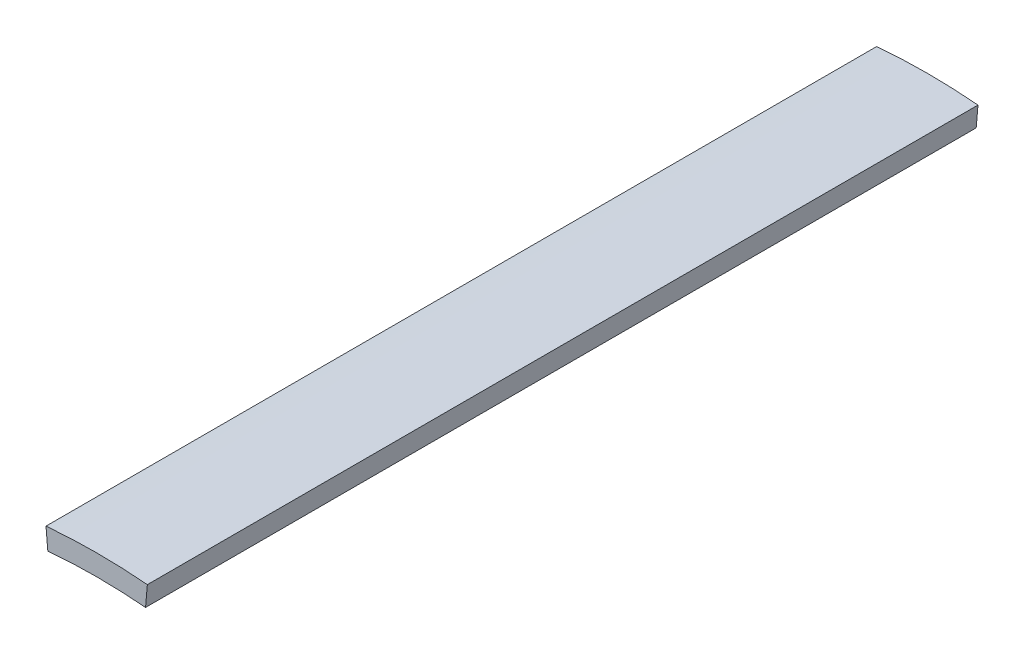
ISO-10303-21;
HEADER;
FILE_DESCRIPTION(('STEP AP214'),'2;1');
FILE_NAME('part.step','',(''),(''),'','','');
FILE_SCHEMA(('AUTOMOTIVE_DESIGN { 1 0 10303 214 1 1 1 1 }'));
ENDSEC;
DATA;
#1=APPLICATION_CONTEXT('core data for automotive mechanical design processes');
#2=APPLICATION_PROTOCOL_DEFINITION('international standard','automotive_design',2000,#1);
#3=PRODUCT_CONTEXT('',#1,'mechanical');
#4=PRODUCT('Part','Part','',(#3));
#5=PRODUCT_RELATED_PRODUCT_CATEGORY('part','',(#4));
#6=PRODUCT_DEFINITION_FORMATION('','',#4);
#7=PRODUCT_DEFINITION_CONTEXT('part definition',#1,'design');
#8=PRODUCT_DEFINITION('design','',#6,#7);
#9=PRODUCT_DEFINITION_SHAPE('','',#8);
#10=(LENGTH_UNIT() NAMED_UNIT(*) SI_UNIT(.MILLI.,.METRE.));
#11=(NAMED_UNIT(*) PLANE_ANGLE_UNIT() SI_UNIT($,.RADIAN.));
#12=(NAMED_UNIT(*) SI_UNIT($,.STERADIAN.) SOLID_ANGLE_UNIT());
#13=UNCERTAINTY_MEASURE_WITH_UNIT(LENGTH_MEASURE(1.E-05),#10,'distance_accuracy_value','');
#14=(GEOMETRIC_REPRESENTATION_CONTEXT(3) GLOBAL_UNCERTAINTY_ASSIGNED_CONTEXT((#13)) GLOBAL_UNIT_ASSIGNED_CONTEXT((#10,
#11,#12)) REPRESENTATION_CONTEXT('',''));
#15=CARTESIAN_POINT('',(0.,0.,0.));
#16=DIRECTION('',(0.,0.,1.));
#17=DIRECTION('',(1.,0.,0.));
#18=AXIS2_PLACEMENT_3D('',#15,#16,#17);
#19=CARTESIAN_POINT('',(0.,0.,10.));
#20=DIRECTION('',(0.,0.,-1.));
#21=DIRECTION('',(-1.,0.,0.));
#22=AXIS2_PLACEMENT_3D('',#19,#20,#21);
#23=CYLINDRICAL_SURFACE('',#22,6.75);
#24=CARTESIAN_POINT('',(0.,0.,0.));
#25=DIRECTION('',(0.,0.,-1.));
#26=DIRECTION('',(1.,0.,0.));
#27=AXIS2_PLACEMENT_3D('',#24,#25,#26);
#28=CIRCLE('',#27,6.75);
#29=CARTESIAN_POINT('',(-0.588301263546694,6.72431421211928,0.));
#30=VERTEX_POINT('',#29);
#31=CARTESIAN_POINT('',(0.588301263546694,6.72431421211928,0.));
#32=VERTEX_POINT('',#31);
#33=EDGE_CURVE('E94',#30,#32,#28,.T.);
#34=ORIENTED_EDGE('',*,*,#33,.T.);
#35=DIRECTION('',(0.,0.,-1.));
#36=VECTOR('',#35,1.);
#37=CARTESIAN_POINT('',(0.588301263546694,6.72431421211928,10.));
#38=LINE('',#37,#36);
#39=CARTESIAN_POINT('',(0.588301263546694,6.72431421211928,10.));
#40=VERTEX_POINT('',#39);
#41=EDGE_CURVE('E11',#40,#32,#38,.T.);
#42=ORIENTED_EDGE('',*,*,#41,.F.);
#43=CARTESIAN_POINT('',(0.,0.,10.));
#44=DIRECTION('',(0.,0.,-1.));
#45=DIRECTION('',(1.,0.,0.));
#46=AXIS2_PLACEMENT_3D('',#43,#44,#45);
#47=CIRCLE('',#46,6.75);
#48=CARTESIAN_POINT('',(-0.588301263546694,6.72431421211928,10.));
#49=VERTEX_POINT('',#48);
#50=EDGE_CURVE('E82',#49,#40,#47,.T.);
#51=ORIENTED_EDGE('',*,*,#50,.F.);
#52=DIRECTION('',(0.,0.,-1.));
#53=VECTOR('',#52,1.);
#54=CARTESIAN_POINT('',(-0.588301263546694,6.72431421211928,10.));
#55=LINE('',#54,#53);
#56=EDGE_CURVE('E90',#49,#30,#55,.T.);
#57=ORIENTED_EDGE('',*,*,#56,.T.);
#58=EDGE_LOOP('',(#34,#42,#51,#57));
#59=FACE_BOUND('',#58,.T.);
#60=ADVANCED_FACE('F31',(#59),#23,.F.);
#61=CARTESIAN_POINT('',(0.588301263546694,6.72431421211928,10.));
#62=DIRECTION('',(-0.996194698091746,0.0871557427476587,0.));
#63=DIRECTION('',(-0.0871557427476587,-0.996194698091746,0.));
#64=AXIS2_PLACEMENT_3D('',#61,#62,#63);
#65=PLANE('',#64);
#66=DIRECTION('',(0.0871557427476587,0.996194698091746,0.));
#67=VECTOR('',#66,1.);
#68=CARTESIAN_POINT('',(0.588301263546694,6.72431421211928,0.));
#69=LINE('',#68,#67);
#70=CARTESIAN_POINT('',(0.610090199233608,6.97336288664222,0.));
#71=VERTEX_POINT('',#70);
#72=EDGE_CURVE('E86',#32,#71,#69,.T.);
#73=ORIENTED_EDGE('',*,*,#72,.T.);
#74=DIRECTION('',(0.,0.,-1.));
#75=VECTOR('',#74,1.);
#76=CARTESIAN_POINT('',(0.610090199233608,6.97336288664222,10.));
#77=LINE('',#76,#75);
#78=CARTESIAN_POINT('',(0.610090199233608,6.97336288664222,10.));
#79=VERTEX_POINT('',#78);
#80=EDGE_CURVE('E39',#79,#71,#77,.T.);
#81=ORIENTED_EDGE('',*,*,#80,.F.);
#82=DIRECTION('',(0.0871557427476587,0.996194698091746,0.));
#83=VECTOR('',#82,1.);
#84=CARTESIAN_POINT('',(0.588301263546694,6.72431421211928,10.));
#85=LINE('',#84,#83);
#86=EDGE_CURVE('E77',#40,#79,#85,.T.);
#87=ORIENTED_EDGE('',*,*,#86,.F.);
#88=ORIENTED_EDGE('',*,*,#41,.T.);
#89=EDGE_LOOP('',(#73,#81,#87,#88));
#90=FACE_BOUND('',#89,.T.);
#91=ADVANCED_FACE('F85',(#90),#65,.F.);
#92=CARTESIAN_POINT('',(0.,0.,10.));
#93=DIRECTION('',(0.,0.,-1.));
#94=DIRECTION('',(-1.,0.,0.));
#95=AXIS2_PLACEMENT_3D('',#92,#93,#94);
#96=CYLINDRICAL_SURFACE('',#95,7.);
#97=CARTESIAN_POINT('',(0.,0.,0.));
#98=DIRECTION('',(0.,0.,1.));
#99=DIRECTION('',(-1.,0.,0.));
#100=AXIS2_PLACEMENT_3D('',#97,#98,#99);
#101=CIRCLE('',#100,7.);
#102=CARTESIAN_POINT('',(-0.610090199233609,6.97336288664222,0.));
#103=VERTEX_POINT('',#102);
#104=EDGE_CURVE('E64',#71,#103,#101,.T.);
#105=ORIENTED_EDGE('',*,*,#104,.T.);
#106=DIRECTION('',(0.,0.,-1.));
#107=VECTOR('',#106,1.);
#108=CARTESIAN_POINT('',(-0.610090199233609,6.97336288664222,10.));
#109=LINE('',#108,#107);
#110=CARTESIAN_POINT('',(-0.610090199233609,6.97336288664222,10.));
#111=VERTEX_POINT('',#110);
#112=EDGE_CURVE('E87',#111,#103,#109,.T.);
#113=ORIENTED_EDGE('',*,*,#112,.F.);
#114=CARTESIAN_POINT('',(0.,0.,10.));
#115=DIRECTION('',(0.,0.,1.));
#116=DIRECTION('',(-1.,0.,0.));
#117=AXIS2_PLACEMENT_3D('',#114,#115,#116);
#118=CIRCLE('',#117,7.);
#119=EDGE_CURVE('E80',#79,#111,#118,.T.);
#120=ORIENTED_EDGE('',*,*,#119,.F.);
#121=ORIENTED_EDGE('',*,*,#80,.T.);
#122=EDGE_LOOP('',(#105,#113,#120,#121));
#123=FACE_BOUND('',#122,.T.);
#124=ADVANCED_FACE('F88',(#123),#96,.T.);
#125=CARTESIAN_POINT('',(-0.588301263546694,6.72431421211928,10.));
#126=DIRECTION('',(0.996194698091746,0.0871557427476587,0.));
#127=DIRECTION('',(-0.0871557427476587,0.996194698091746,0.));
#128=AXIS2_PLACEMENT_3D('',#125,#126,#127);
#129=PLANE('',#128);
#130=DIRECTION('',(0.0871557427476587,-0.996194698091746,0.));
#131=VECTOR('',#130,1.);
#132=CARTESIAN_POINT('',(-0.588301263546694,6.72431421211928,0.));
#133=LINE('',#132,#131);
#134=EDGE_CURVE('E70',#103,#30,#133,.T.);
#135=ORIENTED_EDGE('',*,*,#134,.T.);
#136=ORIENTED_EDGE('',*,*,#56,.F.);
#137=DIRECTION('',(0.0871557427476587,-0.996194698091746,0.));
#138=VECTOR('',#137,1.);
#139=CARTESIAN_POINT('',(-0.588301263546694,6.72431421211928,10.));
#140=LINE('',#139,#138);
#141=EDGE_CURVE('E47',#111,#49,#140,.T.);
#142=ORIENTED_EDGE('',*,*,#141,.F.);
#143=ORIENTED_EDGE('',*,*,#112,.T.);
#144=EDGE_LOOP('',(#135,#136,#142,#143));
#145=FACE_BOUND('',#144,.T.);
#146=ADVANCED_FACE('F101',(#145),#129,.F.);
#147=CARTESIAN_POINT('',(0.,0.,10.));
#148=DIRECTION('',(0.,0.,1.));
#149=DIRECTION('',(1.,0.,0.));
#150=AXIS2_PLACEMENT_3D('',#147,#148,#149);
#151=PLANE('',#150);
#152=ORIENTED_EDGE('',*,*,#50,.T.);
#153=ORIENTED_EDGE('',*,*,#86,.T.);
#154=ORIENTED_EDGE('',*,*,#119,.T.);
#155=ORIENTED_EDGE('',*,*,#141,.T.);
#156=EDGE_LOOP('',(#152,#153,#154,#155));
#157=FACE_BOUND('',#156,.T.);
#158=ADVANCED_FACE('F78',(#157),#151,.T.);
#159=CARTESIAN_POINT('',(0.,0.,0.));
#160=DIRECTION('',(0.,0.,1.));
#161=DIRECTION('',(1.,0.,0.));
#162=AXIS2_PLACEMENT_3D('',#159,#160,#161);
#163=PLANE('',#162);
#164=ORIENTED_EDGE('',*,*,#33,.F.);
#165=ORIENTED_EDGE('',*,*,#134,.F.);
#166=ORIENTED_EDGE('',*,*,#104,.F.);
#167=ORIENTED_EDGE('',*,*,#72,.F.);
#168=EDGE_LOOP('',(#164,#165,#166,#167));
#169=FACE_BOUND('',#168,.T.);
#170=ADVANCED_FACE('F104',(#169),#163,.F.);
#171=CLOSED_SHELL('',(#60,#91,#124,#146,#158,#170));
#172=MANIFOLD_SOLID_BREP('B2',#171);
#173=ADVANCED_BREP_SHAPE_REPRESENTATION('',(#18,#172),#14);
#174=SHAPE_DEFINITION_REPRESENTATION(#9,#173);
ENDSEC;
END-ISO-10303-21;
